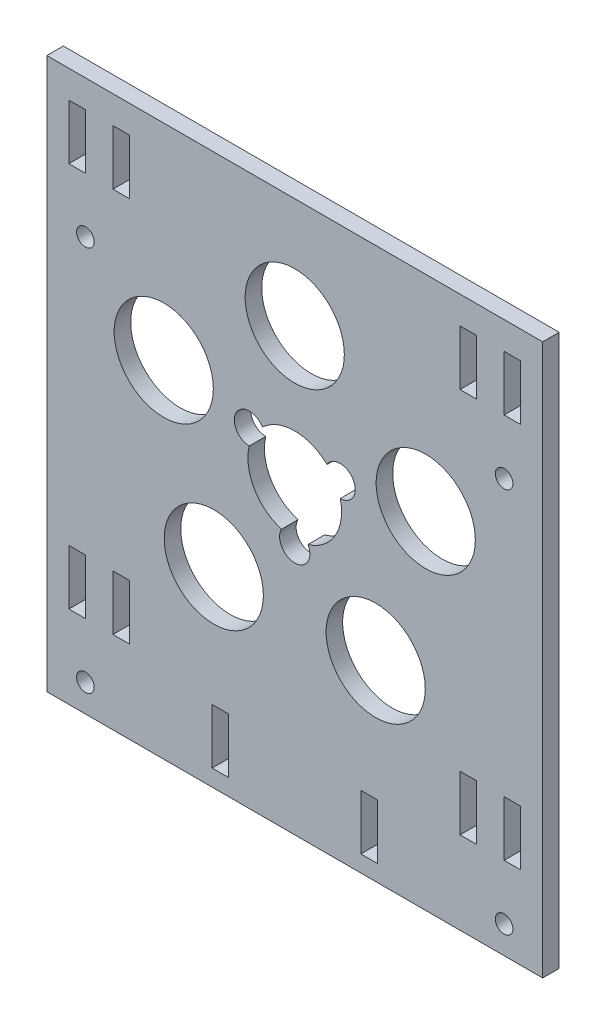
from build123d import *

# Parameters (mm, degrees)
EXTRUDE_2_DEPTH     = 3
SKETCH_5_W          = 3
SKETCH_5_H          = 10
CUT_EXTRUDE_1_DEPTH = 10
SKETCH_6_R          = 9
CUT_EXTRUDE_2_DEPTH = 10
CUT_EXTRUDE_3_DEPTH = 10
SKETCH_8_R          = 1.6
SKETCH_8_W          = 3
SKETCH_8_H          = 10
CUT_EXTRUDE_4_DEPTH = 10


with BuildPart() as part:
    # Sketch 3 → Extrude 2 (new body)
    with BuildSketch(Plane.XY):
        Polygon((45, 45), (-45, 45), (-45, -45), (-45, -55), (45, -55), (45, -45), align=None)
    extrude(amount=EXTRUDE_2_DEPTH)

    # Sketch 5 → Cut-Extrude 1 (cut)
    with BuildSketch(Plane.XY.offset(3)):
        with Locations((-31.5, 35)):
            Rectangle(SKETCH_5_W, SKETCH_5_H)
        with Locations((31.5, 35)):
            Rectangle(SKETCH_5_W, SKETCH_5_H)
        with Locations((-31.5, -35)):
            Rectangle(SKETCH_5_W, SKETCH_5_H)
        with Locations((31.5, -35)):
            Rectangle(SKETCH_5_W, SKETCH_5_H)
    extrude(amount=-CUT_EXTRUDE_1_DEPTH, mode=Mode.SUBTRACT)

    # Sketch 6 → Cut-Extrude 2 (cut)
    with BuildSketch(Plane.XY.offset(3)):
        with Locations((23.776412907, 7.725424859)):
            Circle(SKETCH_6_R)
        with Locations((14.694631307, -20.225424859)):
            Circle(SKETCH_6_R)
        with Locations((-14.694631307, -20.225424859)):
            Circle(SKETCH_6_R)
        with Locations((0, 25)):
            Circle(SKETCH_6_R)
        with Locations((-23.776412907, 7.725424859)):
            Circle(SKETCH_6_R)
    extrude(amount=-CUT_EXTRUDE_2_DEPTH, mode=Mode.SUBTRACT)

    # Sketch 7 → Cut-Extrude 3 (cut)
    with BuildSketch(Plane.XY.offset(3)):
        with BuildLine():
            ThreePointArc((5.862885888, 6.154394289), (0, 8.5), (-5.862885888, 6.154394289))
            ThreePointArc((-5.862885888, 6.154394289), (-10.608811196, 6.125), (-8.261304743, 2.000210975))
            ThreePointArc((-8.261304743, 2.000210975), (-7.361215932, -4.25), (-2.398418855, -8.154605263))
            ThreePointArc((-2.398418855, -8.154605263), (0, -12.25), (2.398418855, -8.154605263))
            ThreePointArc((2.398418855, -8.154605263), (7.361215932, -4.25), (8.261304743, 2.000210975))
            ThreePointArc((8.261304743, 2.000210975), (10.608811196, 6.125), (5.862885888, 6.154394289))
        make_face()
    extrude(amount=-CUT_EXTRUDE_3_DEPTH, mode=Mode.SUBTRACT)

    # Sketch 8 → Cut-Extrude 4 (cut)
    with BuildSketch(Plane.XY.offset(3)):
        with Locations((-38, -50)):
            Circle(SKETCH_8_R)
        with Locations((38, -50)):
            Circle(SKETCH_8_R)
        with Locations((-38, 20)):
            Circle(SKETCH_8_R)
        with Locations((38, 20)):
            Circle(SKETCH_8_R)
        with Locations((-13.5, -47)):
            Rectangle(SKETCH_8_W, SKETCH_8_H)
        with Locations((-39.5, -35)):
            Rectangle(SKETCH_8_W, SKETCH_8_H)
        with Locations((39.5, -35)):
            Rectangle(SKETCH_8_W, SKETCH_8_H)
        with Locations((39.5, 35)):
            Rectangle(SKETCH_8_W, SKETCH_8_H)
        with Locations((-39.5, 35)):
            Rectangle(SKETCH_8_W, SKETCH_8_H)
        with Locations((13.5, -47)):
            Rectangle(SKETCH_8_W, SKETCH_8_H)
    extrude(amount=-CUT_EXTRUDE_4_DEPTH, mode=Mode.SUBTRACT)


solid = part.part
